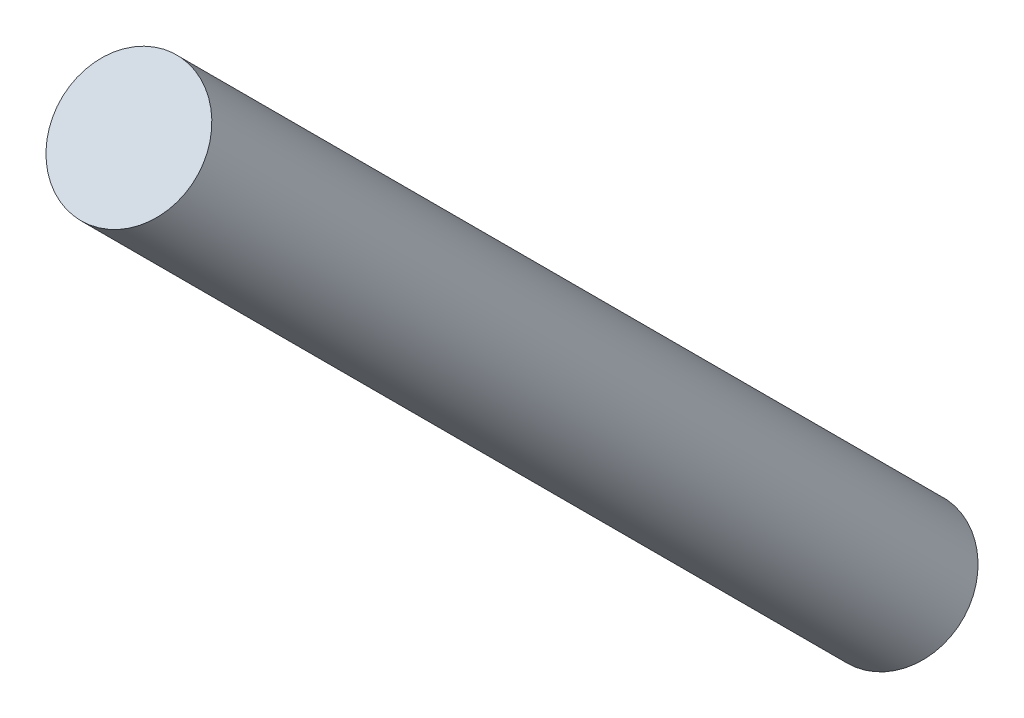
ISO-10303-21;
HEADER;
FILE_DESCRIPTION(('STEP AP214'),'2;1');
FILE_NAME('part.step','',(''),(''),'','','');
FILE_SCHEMA(('AUTOMOTIVE_DESIGN { 1 0 10303 214 1 1 1 1 }'));
ENDSEC;
DATA;
#1=APPLICATION_CONTEXT('core data for automotive mechanical design processes');
#2=APPLICATION_PROTOCOL_DEFINITION('international standard','automotive_design',2000,#1);
#3=PRODUCT_CONTEXT('',#1,'mechanical');
#4=PRODUCT('Part','Part','',(#3));
#5=PRODUCT_RELATED_PRODUCT_CATEGORY('part','',(#4));
#6=PRODUCT_DEFINITION_FORMATION('','',#4);
#7=PRODUCT_DEFINITION_CONTEXT('part definition',#1,'design');
#8=PRODUCT_DEFINITION('design','',#6,#7);
#9=PRODUCT_DEFINITION_SHAPE('','',#8);
#10=(LENGTH_UNIT() NAMED_UNIT(*) SI_UNIT(.MILLI.,.METRE.));
#11=(NAMED_UNIT(*) PLANE_ANGLE_UNIT() SI_UNIT($,.RADIAN.));
#12=(NAMED_UNIT(*) SI_UNIT($,.STERADIAN.) SOLID_ANGLE_UNIT());
#13=UNCERTAINTY_MEASURE_WITH_UNIT(LENGTH_MEASURE(1.E-05),#10,'distance_accuracy_value','');
#14=(GEOMETRIC_REPRESENTATION_CONTEXT(3) GLOBAL_UNCERTAINTY_ASSIGNED_CONTEXT((#13)) GLOBAL_UNIT_ASSIGNED_CONTEXT((#10,
#11,#12)) REPRESENTATION_CONTEXT('',''));
#15=CARTESIAN_POINT('',(0.,0.,0.));
#16=DIRECTION('',(0.,0.,1.));
#17=DIRECTION('',(1.,0.,0.));
#18=AXIS2_PLACEMENT_3D('',#15,#16,#17);
#19=CARTESIAN_POINT('',(0.,71.8420489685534,71.8420489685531));
#20=DIRECTION('',(0.,-0.707106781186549,-0.707106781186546));
#21=DIRECTION('',(0.,0.707106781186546,-0.707106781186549));
#22=AXIS2_PLACEMENT_3D('',#19,#20,#21);
#23=CYLINDRICAL_SURFACE('',#22,6.35);
#24=CARTESIAN_POINT('',(0.,71.8420489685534,71.8420489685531));
#25=DIRECTION('',(0.,0.707106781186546,0.707106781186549));
#26=DIRECTION('',(0.,-0.707106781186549,0.707106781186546));
#27=AXIS2_PLACEMENT_3D('',#24,#25,#26);
#28=CIRCLE('',#27,6.35);
#29=CARTESIAN_POINT('',(0.,67.3519209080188,76.3321770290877));
#30=VERTEX_POINT('',#29);
#31=EDGE_CURVE('E10',#30,#30,#28,.T.);
#32=ORIENTED_EDGE('',*,*,#31,.F.);
#33=EDGE_LOOP('',(#32));
#34=FACE_BOUND('',#33,.T.);
#35=CARTESIAN_POINT('',(0.,0.,0.));
#36=DIRECTION('',(0.,0.707106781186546,0.707106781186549));
#37=DIRECTION('',(0.,-0.707106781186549,0.707106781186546));
#38=AXIS2_PLACEMENT_3D('',#35,#36,#37);
#39=CIRCLE('',#38,6.35);
#40=CARTESIAN_POINT('',(0.,-4.49012806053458,4.49012806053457));
#41=VERTEX_POINT('',#40);
#42=EDGE_CURVE('E37',#41,#41,#39,.T.);
#43=ORIENTED_EDGE('',*,*,#42,.T.);
#44=EDGE_LOOP('',(#43));
#45=FACE_BOUND('',#44,.T.);
#46=ADVANCED_FACE('F34',(#34,#45),#23,.T.);
#47=CARTESIAN_POINT('',(0.,71.8420489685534,71.8420489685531));
#48=DIRECTION('',(0.,0.707106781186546,0.707106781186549));
#49=DIRECTION('',(0.,-0.707106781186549,0.707106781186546));
#50=AXIS2_PLACEMENT_3D('',#47,#48,#49);
#51=PLANE('',#50);
#52=ORIENTED_EDGE('',*,*,#31,.T.);
#53=EDGE_LOOP('',(#52));
#54=FACE_BOUND('',#53,.T.);
#55=ADVANCED_FACE('F49',(#54),#51,.T.);
#56=CARTESIAN_POINT('',(0.,0.,0.));
#57=DIRECTION('',(0.,0.707106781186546,0.707106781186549));
#58=DIRECTION('',(0.,-0.707106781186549,0.707106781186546));
#59=AXIS2_PLACEMENT_3D('',#56,#57,#58);
#60=PLANE('',#59);
#61=ORIENTED_EDGE('',*,*,#42,.F.);
#62=EDGE_LOOP('',(#61));
#63=FACE_BOUND('',#62,.T.);
#64=ADVANCED_FACE('F47',(#63),#60,.F.);
#65=CLOSED_SHELL('',(#46,#55,#64));
#66=MANIFOLD_SOLID_BREP('B2',#65);
#67=ADVANCED_BREP_SHAPE_REPRESENTATION('',(#18,#66),#14);
#68=SHAPE_DEFINITION_REPRESENTATION(#9,#67);
ENDSEC;
END-ISO-10303-21;
